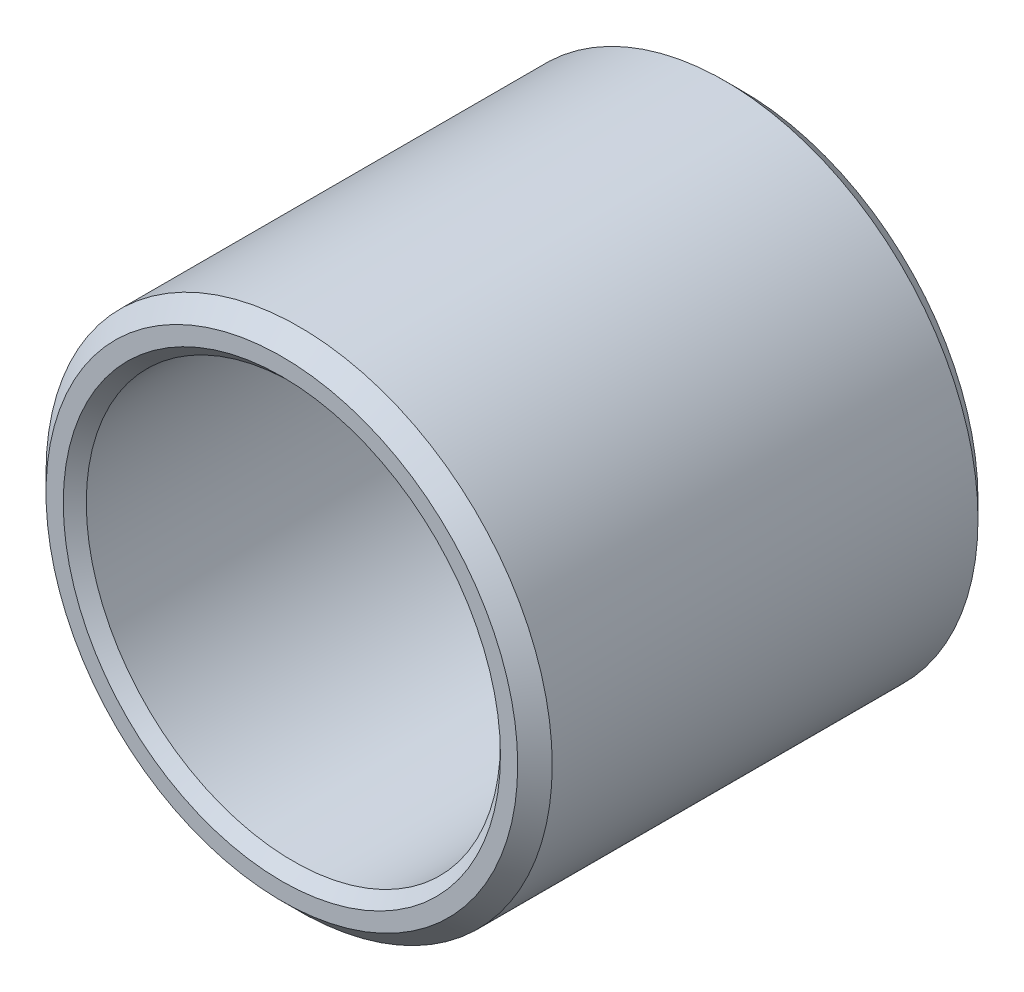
ISO-10303-21;
HEADER;
FILE_DESCRIPTION(('STEP AP214'),'2;1');
FILE_NAME('part.step','',(''),(''),'','','');
FILE_SCHEMA(('AUTOMOTIVE_DESIGN { 1 0 10303 214 1 1 1 1 }'));
ENDSEC;
DATA;
#1=APPLICATION_CONTEXT('core data for automotive mechanical design processes');
#2=APPLICATION_PROTOCOL_DEFINITION('international standard','automotive_design',2000,#1);
#3=PRODUCT_CONTEXT('',#1,'mechanical');
#4=PRODUCT('Part','Part','',(#3));
#5=PRODUCT_RELATED_PRODUCT_CATEGORY('part','',(#4));
#6=PRODUCT_DEFINITION_FORMATION('','',#4);
#7=PRODUCT_DEFINITION_CONTEXT('part definition',#1,'design');
#8=PRODUCT_DEFINITION('design','',#6,#7);
#9=PRODUCT_DEFINITION_SHAPE('','',#8);
#10=(LENGTH_UNIT() NAMED_UNIT(*) SI_UNIT(.MILLI.,.METRE.));
#11=(NAMED_UNIT(*) PLANE_ANGLE_UNIT() SI_UNIT($,.RADIAN.));
#12=(NAMED_UNIT(*) SI_UNIT($,.STERADIAN.) SOLID_ANGLE_UNIT());
#13=UNCERTAINTY_MEASURE_WITH_UNIT(LENGTH_MEASURE(1.E-05),#10,'distance_accuracy_value','');
#14=(GEOMETRIC_REPRESENTATION_CONTEXT(3) GLOBAL_UNCERTAINTY_ASSIGNED_CONTEXT((#13)) GLOBAL_UNIT_ASSIGNED_CONTEXT((#10,
#11,#12)) REPRESENTATION_CONTEXT('',''));
#15=CARTESIAN_POINT('',(0.,0.,0.));
#16=DIRECTION('',(0.,0.,1.));
#17=DIRECTION('',(1.,0.,0.));
#18=AXIS2_PLACEMENT_3D('',#15,#16,#17);
#19=CARTESIAN_POINT('',(0.,14.284325,0.));
#20=DIRECTION('',(0.,0.,1.));
#21=DIRECTION('',(1.,0.,0.));
#22=AXIS2_PLACEMENT_3D('',#19,#20,#21);
#23=PLANE('',#22);
#24=CARTESIAN_POINT('',(0.,0.,0.));
#25=DIRECTION('',(0.,0.,1.));
#26=DIRECTION('',(1.,0.,0.));
#27=AXIS2_PLACEMENT_3D('',#24,#25,#26);
#28=CIRCLE('',#27,16.2687);
#29=CARTESIAN_POINT('',(16.2687,0.,0.));
#30=VERTEX_POINT('',#29);
#31=EDGE_CURVE('E10',#30,#30,#28,.T.);
#32=ORIENTED_EDGE('',*,*,#31,.T.);
#33=EDGE_LOOP('',(#32));
#34=FACE_BOUND('',#33,.T.);
#35=CARTESIAN_POINT('',(0.,0.,0.));
#36=DIRECTION('',(0.,0.,1.));
#37=DIRECTION('',(1.,0.,0.));
#38=AXIS2_PLACEMENT_3D('',#35,#36,#37);
#39=CIRCLE('',#38,15.078075);
#40=CARTESIAN_POINT('',(15.078075,0.,0.));
#41=VERTEX_POINT('',#40);
#42=EDGE_CURVE('E48',#41,#41,#39,.F.);
#43=ORIENTED_EDGE('',*,*,#42,.T.);
#44=EDGE_LOOP('',(#43));
#45=FACE_BOUND('',#44,.T.);
#46=ADVANCED_FACE('F29',(#34,#45),#23,.T.);
#47=CARTESIAN_POINT('',(0.,0.,0.));
#48=DIRECTION('',(0.,0.,-1.));
#49=DIRECTION('',(-1.,0.,0.));
#50=AXIS2_PLACEMENT_3D('',#47,#48,#49);
#51=CYLINDRICAL_SURFACE('',#50,17.459325);
#52=CARTESIAN_POINT('',(0.,0.,-30.559375));
#53=DIRECTION('',(0.,0.,-1.));
#54=DIRECTION('',(-1.,0.,0.));
#55=AXIS2_PLACEMENT_3D('',#52,#53,#54);
#56=CIRCLE('',#55,17.459325);
#57=CARTESIAN_POINT('',(17.459325,0.,-30.559375));
#58=VERTEX_POINT('',#57);
#59=EDGE_CURVE('E35',#58,#58,#56,.F.);
#60=ORIENTED_EDGE('',*,*,#59,.T.);
#61=EDGE_LOOP('',(#60));
#62=FACE_BOUND('',#61,.T.);
#63=CARTESIAN_POINT('',(0.,0.,-1.190625));
#64=DIRECTION('',(0.,0.,1.));
#65=DIRECTION('',(1.,0.,0.));
#66=AXIS2_PLACEMENT_3D('',#63,#64,#65);
#67=CIRCLE('',#66,17.459325);
#68=CARTESIAN_POINT('',(17.459325,0.,-1.190625));
#69=VERTEX_POINT('',#68);
#70=EDGE_CURVE('E39',#69,#69,#67,.F.);
#71=ORIENTED_EDGE('',*,*,#70,.T.);
#72=EDGE_LOOP('',(#71));
#73=FACE_BOUND('',#72,.T.);
#74=ADVANCED_FACE('F72',(#62,#73),#51,.T.);
#75=CARTESIAN_POINT('',(0.,14.284325,-31.75));
#76=DIRECTION('',(0.,0.,-1.));
#77=DIRECTION('',(-1.,0.,0.));
#78=AXIS2_PLACEMENT_3D('',#75,#76,#77);
#79=PLANE('',#78);
#80=CARTESIAN_POINT('',(0.,0.,-31.75));
#81=DIRECTION('',(0.,0.,-1.));
#82=DIRECTION('',(-1.,0.,0.));
#83=AXIS2_PLACEMENT_3D('',#80,#81,#82);
#84=CIRCLE('',#83,16.2687);
#85=CARTESIAN_POINT('',(16.2687,0.,-31.75));
#86=VERTEX_POINT('',#85);
#87=EDGE_CURVE('E43',#86,#86,#84,.T.);
#88=ORIENTED_EDGE('',*,*,#87,.T.);
#89=EDGE_LOOP('',(#88));
#90=FACE_BOUND('',#89,.T.);
#91=CARTESIAN_POINT('',(0.,0.,-31.75));
#92=DIRECTION('',(0.,0.,-1.));
#93=DIRECTION('',(-1.,0.,0.));
#94=AXIS2_PLACEMENT_3D('',#91,#92,#93);
#95=CIRCLE('',#94,15.078075);
#96=CARTESIAN_POINT('',(-15.078075,0.,-31.75));
#97=VERTEX_POINT('',#96);
#98=EDGE_CURVE('E51',#97,#97,#95,.F.);
#99=ORIENTED_EDGE('',*,*,#98,.T.);
#100=EDGE_LOOP('',(#99));
#101=FACE_BOUND('',#100,.T.);
#102=ADVANCED_FACE('F76',(#90,#101),#79,.T.);
#103=CARTESIAN_POINT('',(0.,0.,0.));
#104=DIRECTION('',(0.,0.,-1.));
#105=DIRECTION('',(-1.,0.,0.));
#106=AXIS2_PLACEMENT_3D('',#103,#104,#105);
#107=CYLINDRICAL_SURFACE('',#106,14.284325);
#108=CARTESIAN_POINT('',(0.,0.,-30.95625));
#109=DIRECTION('',(0.,0.,-1.));
#110=DIRECTION('',(-1.,0.,0.));
#111=AXIS2_PLACEMENT_3D('',#108,#109,#110);
#112=CIRCLE('',#111,14.284325);
#113=CARTESIAN_POINT('',(-14.284325,0.,-30.95625));
#114=VERTEX_POINT('',#113);
#115=EDGE_CURVE('E54',#114,#114,#112,.T.);
#116=ORIENTED_EDGE('',*,*,#115,.T.);
#117=EDGE_LOOP('',(#116));
#118=FACE_BOUND('',#117,.T.);
#119=CARTESIAN_POINT('',(0.,0.,-0.793750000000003));
#120=DIRECTION('',(0.,0.,1.));
#121=DIRECTION('',(1.,0.,0.));
#122=AXIS2_PLACEMENT_3D('',#119,#120,#121);
#123=CIRCLE('',#122,14.284325);
#124=CARTESIAN_POINT('',(14.284325,0.,-0.793750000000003));
#125=VERTEX_POINT('',#124);
#126=EDGE_CURVE('E57',#125,#125,#123,.T.);
#127=ORIENTED_EDGE('',*,*,#126,.T.);
#128=EDGE_LOOP('',(#127));
#129=FACE_BOUND('',#128,.T.);
#130=ADVANCED_FACE('F61',(#118,#129),#107,.F.);
#131=CARTESIAN_POINT('',(0.,0.,-30.95625));
#132=DIRECTION('',(0.,0.,-1.));
#133=DIRECTION('',(-1.,0.,0.));
#134=AXIS2_PLACEMENT_3D('',#131,#132,#133);
#135=CONICAL_SURFACE('',#134,14.284325,0.785398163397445);
#136=ORIENTED_EDGE('',*,*,#98,.F.);
#137=EDGE_LOOP('',(#136));
#138=FACE_BOUND('',#137,.T.);
#139=ORIENTED_EDGE('',*,*,#115,.F.);
#140=EDGE_LOOP('',(#139));
#141=FACE_BOUND('',#140,.T.);
#142=ADVANCED_FACE('F67',(#138,#141),#135,.F.);
#143=CARTESIAN_POINT('',(0.,0.,0.));
#144=DIRECTION('',(0.,0.,1.));
#145=DIRECTION('',(1.,0.,0.));
#146=AXIS2_PLACEMENT_3D('',#143,#144,#145);
#147=CONICAL_SURFACE('',#146,15.078075,0.785398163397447);
#148=CARTESIAN_POINT('',(14.284325,0.,-0.793750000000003));
#149=CARTESIAN_POINT('',(14.2925932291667,0.,-0.785481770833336));
#150=CARTESIAN_POINT('',(14.3008614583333,0.,-0.777213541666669));
#151=CARTESIAN_POINT('',(14.3173979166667,0.,-0.760677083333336));
#152=CARTESIAN_POINT('',(14.3256661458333,0.,-0.75240885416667));
#153=CARTESIAN_POINT('',(14.3422026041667,0.,-0.735872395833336));
#154=CARTESIAN_POINT('',(14.3504708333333,0.,-0.727604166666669));
#155=CARTESIAN_POINT('',(14.3670072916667,0.,-0.711067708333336));
#156=CARTESIAN_POINT('',(14.3752755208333,0.,-0.702799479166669));
#157=CARTESIAN_POINT('',(14.3918119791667,0.,-0.686263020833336));
#158=CARTESIAN_POINT('',(14.4000802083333,0.,-0.677994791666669));
#159=CARTESIAN_POINT('',(14.4166166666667,0.,-0.661458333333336));
#160=CARTESIAN_POINT('',(14.4248848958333,0.,-0.653190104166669));
#161=CARTESIAN_POINT('',(14.4414213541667,0.,-0.636653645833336));
#162=CARTESIAN_POINT('',(14.4496895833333,0.,-0.628385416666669));
#163=CARTESIAN_POINT('',(14.4662260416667,0.,-0.611848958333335));
#164=CARTESIAN_POINT('',(14.4744942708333,0.,-0.603580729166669));
#165=CARTESIAN_POINT('',(14.4910307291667,0.,-0.587044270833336));
#166=CARTESIAN_POINT('',(14.4992989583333,0.,-0.578776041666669));
#167=CARTESIAN_POINT('',(14.5158354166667,0.,-0.562239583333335));
#168=CARTESIAN_POINT('',(14.5241036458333,0.,-0.553971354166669));
#169=CARTESIAN_POINT('',(14.5406401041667,0.,-0.537434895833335));
#170=CARTESIAN_POINT('',(14.5489083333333,0.,-0.529166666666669));
#171=CARTESIAN_POINT('',(14.5654447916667,0.,-0.512630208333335));
#172=CARTESIAN_POINT('',(14.5737130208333,0.,-0.504361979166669));
#173=CARTESIAN_POINT('',(14.5902494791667,0.,-0.487825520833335));
#174=CARTESIAN_POINT('',(14.5985177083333,0.,-0.479557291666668));
#175=CARTESIAN_POINT('',(14.6150541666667,0.,-0.463020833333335));
#176=CARTESIAN_POINT('',(14.6233223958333,0.,-0.454752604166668));
#177=CARTESIAN_POINT('',(14.6398588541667,0.,-0.438216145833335));
#178=CARTESIAN_POINT('',(14.6481270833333,0.,-0.429947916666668));
#179=CARTESIAN_POINT('',(14.6646635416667,0.,-0.413411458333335));
#180=CARTESIAN_POINT('',(14.6729317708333,0.,-0.405143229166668));
#181=CARTESIAN_POINT('',(14.6894682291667,0.,-0.388606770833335));
#182=CARTESIAN_POINT('',(14.6977364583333,0.,-0.380338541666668));
#183=CARTESIAN_POINT('',(14.7142729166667,0.,-0.363802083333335));
#184=CARTESIAN_POINT('',(14.7225411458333,0.,-0.355533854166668));
#185=CARTESIAN_POINT('',(14.7390776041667,0.,-0.338997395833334));
#186=CARTESIAN_POINT('',(14.7473458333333,0.,-0.330729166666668));
#187=CARTESIAN_POINT('',(14.7638822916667,0.,-0.314192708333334));
#188=CARTESIAN_POINT('',(14.7721505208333,0.,-0.305924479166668));
#189=CARTESIAN_POINT('',(14.7886869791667,0.,-0.289388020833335));
#190=CARTESIAN_POINT('',(14.7969552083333,0.,-0.281119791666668));
#191=CARTESIAN_POINT('',(14.8134916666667,0.,-0.264583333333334));
#192=CARTESIAN_POINT('',(14.8217598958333,0.,-0.256315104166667));
#193=CARTESIAN_POINT('',(14.8382963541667,0.,-0.239778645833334));
#194=CARTESIAN_POINT('',(14.8465645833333,0.,-0.231510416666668));
#195=CARTESIAN_POINT('',(14.8631010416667,0.,-0.214973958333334));
#196=CARTESIAN_POINT('',(14.8713692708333,0.,-0.206705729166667));
#197=CARTESIAN_POINT('',(14.8879057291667,0.,-0.190169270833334));
#198=CARTESIAN_POINT('',(14.8961739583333,0.,-0.181901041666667));
#199=CARTESIAN_POINT('',(14.9127104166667,0.,-0.165364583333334));
#200=CARTESIAN_POINT('',(14.9209786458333,0.,-0.157096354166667));
#201=CARTESIAN_POINT('',(14.9375151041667,0.,-0.140559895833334));
#202=CARTESIAN_POINT('',(14.9457833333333,0.,-0.132291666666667));
#203=CARTESIAN_POINT('',(14.9623197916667,0.,-0.115755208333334));
#204=CARTESIAN_POINT('',(14.9705880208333,0.,-0.107486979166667));
#205=CARTESIAN_POINT('',(14.9871244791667,0.,-0.0909505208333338));
#206=CARTESIAN_POINT('',(14.9953927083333,0.,-0.082682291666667));
#207=CARTESIAN_POINT('',(15.0119291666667,0.,-0.0661458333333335));
#208=CARTESIAN_POINT('',(15.0201973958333,0.,-0.0578776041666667));
#209=CARTESIAN_POINT('',(15.0367338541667,0.,-0.0413411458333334));
#210=CARTESIAN_POINT('',(15.0450020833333,0.,-0.0330729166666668));
#211=CARTESIAN_POINT('',(15.0615385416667,0.,-0.0165364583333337));
#212=CARTESIAN_POINT('',(15.0698067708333,0.,-0.00826822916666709));
#213=CARTESIAN_POINT('',(15.078075,0.,0.));
#214=B_SPLINE_CURVE_WITH_KNOTS('',3,(#148,#149,#150,#151,#152,#153,#154,#155,#156,#157,#158,
#159,#160,#161,#162,#163,#164,#165,#166,#167,#168,#169,#170,#171,#172,#173,#174,#175,#176,#177,
#178,#179,#180,#181,#182,#183,#184,#185,#186,#187,#188,#189,#190,#191,#192,#193,#194,#195,#196,
#197,#198,#199,#200,#201,#202,#203,#204,#205,#206,#207,#208,#209,#210,#211,#212,#213),
.UNSPECIFIED.,.F.,.F.,(4,2,2,2,2,2,2,2,2,2,2,2,2,2,2,2,2,2,2,2,2,2,2,2,2,2,2,2,2,2,2,2,4),(0.,
0.035079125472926,0.0701582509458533,0.105237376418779,0.140316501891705,0.175395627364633,
0.210474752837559,0.245553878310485,0.280633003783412,0.315712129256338,0.350791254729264,
0.385870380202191,0.420949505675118,0.456028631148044,0.491107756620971,0.526186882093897,
0.561266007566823,0.59634513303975,0.631424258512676,0.666503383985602,0.701582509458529,
0.736661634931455,0.771740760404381,0.806819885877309,0.841899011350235,0.876978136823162,
0.912057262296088,0.947136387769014,0.982215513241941,1.01729463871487,1.05237376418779,
1.08745288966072,1.12253201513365),.UNSPECIFIED.);
#215=EDGE_CURVE('BSEAM63',#125,#41,#214,.T.);
#216=ORIENTED_EDGE('',*,*,#126,.F.);
#217=ORIENTED_EDGE('',*,*,#42,.F.);
#218=ORIENTED_EDGE('',*,*,#215,.T.);
#219=ORIENTED_EDGE('',*,*,#215,.F.);
#220=EDGE_LOOP('',(#216,#218,#217,#219));
#221=FACE_BOUND('',#220,.T.);
#222=ADVANCED_FACE('F63',(#221),#147,.F.);
#223=CARTESIAN_POINT('',(0.,0.,-31.75));
#224=DIRECTION('',(0.,0.,1.));
#225=DIRECTION('',(1.,0.,0.));
#226=AXIS2_PLACEMENT_3D('',#223,#224,#225);
#227=CONICAL_SURFACE('',#226,16.2687,0.785398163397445);
#228=CARTESIAN_POINT('',(17.459325,0.,-30.559375));
#229=CARTESIAN_POINT('',(17.44692265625,0.,-30.57177734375));
#230=CARTESIAN_POINT('',(17.4345203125,0.,-30.5841796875));
#231=CARTESIAN_POINT('',(17.409715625,0.,-30.608984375));
#232=CARTESIAN_POINT('',(17.39731328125,0.,-30.62138671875));
#233=CARTESIAN_POINT('',(17.37250859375,0.,-30.64619140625));
#234=CARTESIAN_POINT('',(17.36010625,0.,-30.65859375));
#235=CARTESIAN_POINT('',(17.3353015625,0.,-30.6833984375));
#236=CARTESIAN_POINT('',(17.32289921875,0.,-30.69580078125));
#237=CARTESIAN_POINT('',(17.29809453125,0.,-30.72060546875));
#238=CARTESIAN_POINT('',(17.2856921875,0.,-30.7330078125));
#239=CARTESIAN_POINT('',(17.2608875,0.,-30.7578125));
#240=CARTESIAN_POINT('',(17.24848515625,0.,-30.77021484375));
#241=CARTESIAN_POINT('',(17.22368046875,0.,-30.79501953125));
#242=CARTESIAN_POINT('',(17.211278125,0.,-30.807421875));
#243=CARTESIAN_POINT('',(17.1864734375,0.,-30.8322265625));
#244=CARTESIAN_POINT('',(17.17407109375,0.,-30.84462890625));
#245=CARTESIAN_POINT('',(17.14926640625,0.,-30.86943359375));
#246=CARTESIAN_POINT('',(17.1368640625,0.,-30.8818359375));
#247=CARTESIAN_POINT('',(17.112059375,0.,-30.906640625));
#248=CARTESIAN_POINT('',(17.09965703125,0.,-30.91904296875));
#249=CARTESIAN_POINT('',(17.07485234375,0.,-30.94384765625));
#250=CARTESIAN_POINT('',(17.06245,0.,-30.95625));
#251=CARTESIAN_POINT('',(17.0376453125,0.,-30.9810546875));
#252=CARTESIAN_POINT('',(17.02524296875,0.,-30.99345703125));
#253=CARTESIAN_POINT('',(17.00043828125,0.,-31.01826171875));
#254=CARTESIAN_POINT('',(16.9880359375,0.,-31.0306640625));
#255=CARTESIAN_POINT('',(16.96323125,0.,-31.05546875));
#256=CARTESIAN_POINT('',(16.95082890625,0.,-31.06787109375));
#257=CARTESIAN_POINT('',(16.92602421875,0.,-31.09267578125));
#258=CARTESIAN_POINT('',(16.913621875,0.,-31.105078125));
#259=CARTESIAN_POINT('',(16.8888171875,0.,-31.1298828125));
#260=CARTESIAN_POINT('',(16.87641484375,0.,-31.14228515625));
#261=CARTESIAN_POINT('',(16.85161015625,0.,-31.16708984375));
#262=CARTESIAN_POINT('',(16.8392078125,0.,-31.1794921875));
#263=CARTESIAN_POINT('',(16.814403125,0.,-31.204296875));
#264=CARTESIAN_POINT('',(16.80200078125,0.,-31.21669921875));
#265=CARTESIAN_POINT('',(16.77719609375,0.,-31.24150390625));
#266=CARTESIAN_POINT('',(16.76479375,0.,-31.25390625));
#267=CARTESIAN_POINT('',(16.7399890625,0.,-31.2787109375));
#268=CARTESIAN_POINT('',(16.72758671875,0.,-31.29111328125));
#269=CARTESIAN_POINT('',(16.70278203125,0.,-31.31591796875));
#270=CARTESIAN_POINT('',(16.6903796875,0.,-31.3283203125));
#271=CARTESIAN_POINT('',(16.665575,0.,-31.353125));
#272=CARTESIAN_POINT('',(16.65317265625,0.,-31.36552734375));
#273=CARTESIAN_POINT('',(16.62836796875,0.,-31.39033203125));
#274=CARTESIAN_POINT('',(16.615965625,0.,-31.402734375));
#275=CARTESIAN_POINT('',(16.5911609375,0.,-31.4275390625));
#276=CARTESIAN_POINT('',(16.57875859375,0.,-31.43994140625));
#277=CARTESIAN_POINT('',(16.55395390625,0.,-31.46474609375));
#278=CARTESIAN_POINT('',(16.5415515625,0.,-31.4771484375));
#279=CARTESIAN_POINT('',(16.516746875,0.,-31.501953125));
#280=CARTESIAN_POINT('',(16.50434453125,0.,-31.51435546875));
#281=CARTESIAN_POINT('',(16.47953984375,0.,-31.53916015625));
#282=CARTESIAN_POINT('',(16.4671375,0.,-31.5515625));
#283=CARTESIAN_POINT('',(16.4423328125,0.,-31.5763671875));
#284=CARTESIAN_POINT('',(16.42993046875,0.,-31.58876953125));
#285=CARTESIAN_POINT('',(16.40512578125,0.,-31.61357421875));
#286=CARTESIAN_POINT('',(16.3927234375,0.,-31.6259765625));
#287=CARTESIAN_POINT('',(16.36791875,0.,-31.65078125));
#288=CARTESIAN_POINT('',(16.35551640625,0.,-31.66318359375));
#289=CARTESIAN_POINT('',(16.33071171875,0.,-31.68798828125));
#290=CARTESIAN_POINT('',(16.318309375,0.,-31.700390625));
#291=CARTESIAN_POINT('',(16.2935046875,0.,-31.7251953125));
#292=CARTESIAN_POINT('',(16.28110234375,0.,-31.73759765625));
#293=CARTESIAN_POINT('',(16.2687,0.,-31.75));
#294=B_SPLINE_CURVE_WITH_KNOTS('',3,(#228,#229,#230,#231,#232,#233,#234,#235,#236,#237,#238,
#239,#240,#241,#242,#243,#244,#245,#246,#247,#248,#249,#250,#251,#252,#253,#254,#255,#256,#257,
#258,#259,#260,#261,#262,#263,#264,#265,#266,#267,#268,#269,#270,#271,#272,#273,#274,#275,#276,
#277,#278,#279,#280,#281,#282,#283,#284,#285,#286,#287,#288,#289,#290,#291,#292,#293),
.UNSPECIFIED.,.F.,.F.,(4,2,2,2,2,2,2,2,2,2,2,2,2,2,2,2,2,2,2,2,2,2,2,2,2,2,2,2,2,2,2,2,4),(0.,
0.0526186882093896,0.105237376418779,0.157856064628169,0.210474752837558,0.263093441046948,
0.315712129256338,0.368330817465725,0.420949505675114,0.473568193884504,0.526186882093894,
0.578805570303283,0.631424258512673,0.68404294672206,0.736661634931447,0.789280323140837,
0.841899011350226,0.894517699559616,0.947136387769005,0.999755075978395,1.05237376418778,
1.10499245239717,1.15761114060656,1.21022982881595,1.26284851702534,1.31546720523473,
1.36808589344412,1.42070458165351,1.4733232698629,1.52594195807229,1.57856064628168,
1.63117933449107,1.68379802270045),.UNSPECIFIED.);
#295=EDGE_CURVE('BSEAM66',#58,#86,#294,.T.);
#296=ORIENTED_EDGE('',*,*,#59,.F.);
#297=ORIENTED_EDGE('',*,*,#87,.F.);
#298=ORIENTED_EDGE('',*,*,#295,.T.);
#299=ORIENTED_EDGE('',*,*,#295,.F.);
#300=EDGE_LOOP('',(#296,#298,#297,#299));
#301=FACE_BOUND('',#300,.T.);
#302=ADVANCED_FACE('F66',(#301),#227,.T.);
#303=CARTESIAN_POINT('',(0.,0.,-1.190625));
#304=DIRECTION('',(0.,0.,-1.));
#305=DIRECTION('',(-1.,0.,0.));
#306=AXIS2_PLACEMENT_3D('',#303,#304,#305);
#307=CONICAL_SURFACE('',#306,17.459325,0.785398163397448);
#308=ORIENTED_EDGE('',*,*,#31,.F.);
#309=EDGE_LOOP('',(#308));
#310=FACE_BOUND('',#309,.T.);
#311=ORIENTED_EDGE('',*,*,#70,.F.);
#312=EDGE_LOOP('',(#311));
#313=FACE_BOUND('',#312,.T.);
#314=ADVANCED_FACE('F92',(#310,#313),#307,.T.);
#315=CLOSED_SHELL('',(#46,#74,#102,#130,#142,#222,#302,#314));
#316=MANIFOLD_SOLID_BREP('B2',#315);
#317=ADVANCED_BREP_SHAPE_REPRESENTATION('',(#18,#316),#14);
#318=SHAPE_DEFINITION_REPRESENTATION(#9,#317);
ENDSEC;
END-ISO-10303-21;
